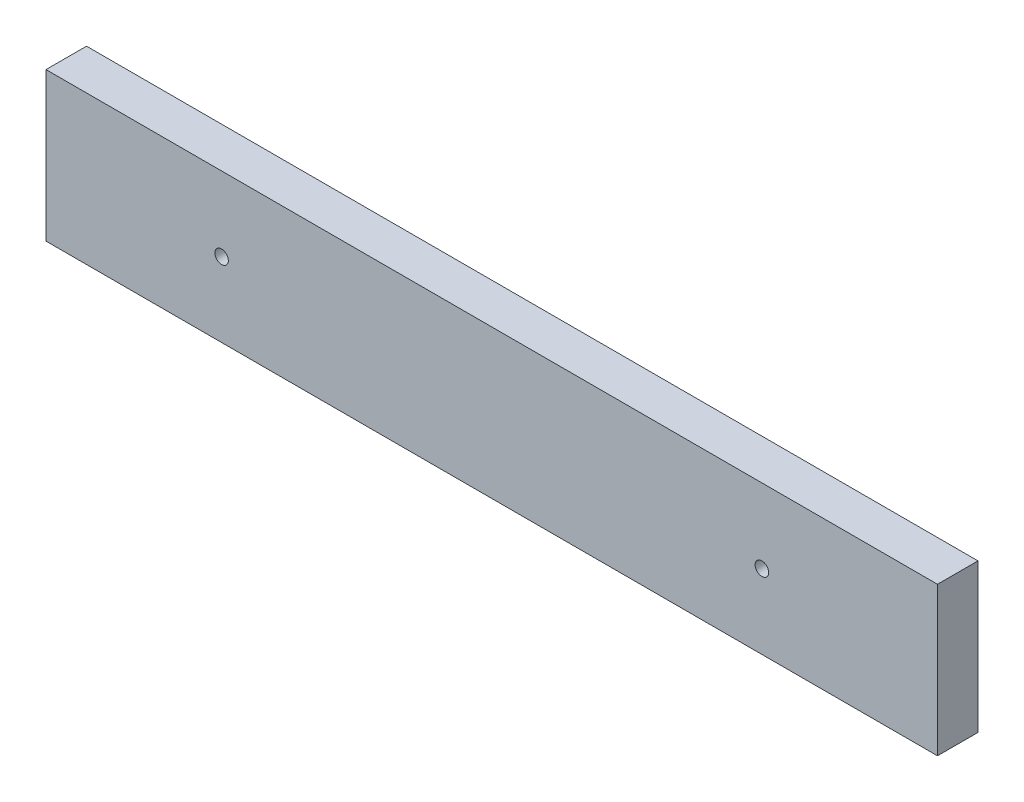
from build123d import *

# Parameters (mm, degrees)
SKETCH2_W           = 38.1
SKETCH2_H           = 139.7
BOSS_EXTRUDE1_DEPTH = 838.2
SKETCH3_R           = 6.35
CUT_EXTRUDE1_DEPTH  = 842.967857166


with BuildPart() as part:
    # Sketch2 → Boss-Extrude1 (new body)
    with BuildSketch(Plane(origin=(0, 0, 0), x_dir=(0, 0, -1), z_dir=(1, 0, 0))):
        Rectangle(SKETCH2_W, SKETCH2_H)
    extrude(amount=BOSS_EXTRUDE1_DEPTH)

    # Sketch3 → Cut-Extrude1 (cut, through all)
    with BuildSketch(Plane.XY.offset(19.05)):
        with Locations((165.1, 0)):
            Circle(SKETCH3_R)
        with Locations((673.1, 0)):
            Circle(SKETCH3_R)
    extrude(amount=-CUT_EXTRUDE1_DEPTH, mode=Mode.SUBTRACT)


solid = part.part
